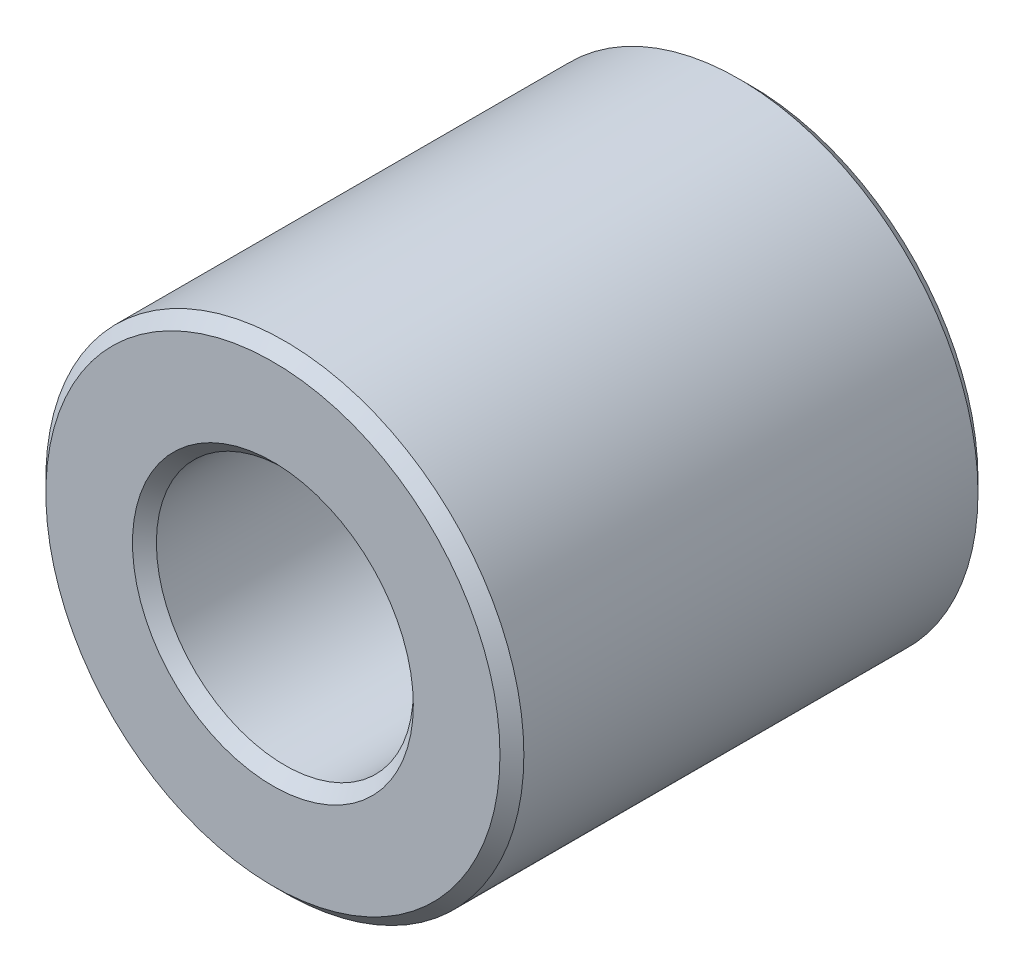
from build123d import *

# Parameters (mm, degrees)
SKETCH1_R           = 4
SKETCH1_R_2         = 2.15
BOSS_EXTRUDE2_DEPTH = 4
CHAMFER3_SIZE       = 0.2


with BuildPart() as part:
    # Sketch1 → Boss-Extrude2 (new, symmetric)
    with BuildSketch(Plane.XY):
        Circle(SKETCH1_R)
        Circle(SKETCH1_R_2, mode=Mode.SUBTRACT)
    extrude(amount=BOSS_EXTRUDE2_DEPTH, both=True)

    # Chamfer3
    chamfer3_edges = [part.edges().sort_by_distance(p)[0] for p in [
        (-4, 0, -4),
        (-4, 0, 4),
        (-2.15, 0, -4),
        (-2.15, 0, 4),
    ]]
    chamfer(chamfer3_edges, length=CHAMFER3_SIZE)


solid = part.part
